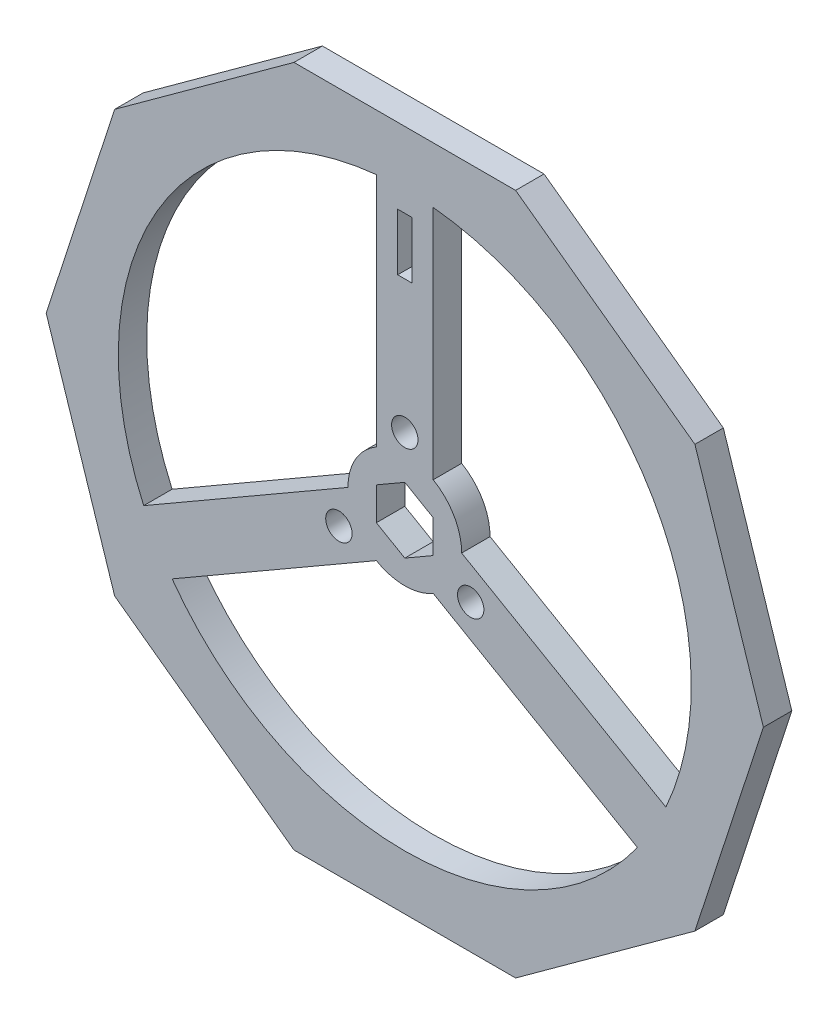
ISO-10303-21;
HEADER;
FILE_DESCRIPTION(('STEP AP214'),'2;1');
FILE_NAME('part.step','',(''),(''),'','','');
FILE_SCHEMA(('AUTOMOTIVE_DESIGN { 1 0 10303 214 1 1 1 1 }'));
ENDSEC;
DATA;
#1=APPLICATION_CONTEXT('core data for automotive mechanical design processes');
#2=APPLICATION_PROTOCOL_DEFINITION('international standard','automotive_design',2000,#1);
#3=PRODUCT_CONTEXT('',#1,'mechanical');
#4=PRODUCT('Part','Part','',(#3));
#5=PRODUCT_RELATED_PRODUCT_CATEGORY('part','',(#4));
#6=PRODUCT_DEFINITION_FORMATION('','',#4);
#7=PRODUCT_DEFINITION_CONTEXT('part definition',#1,'design');
#8=PRODUCT_DEFINITION('design','',#6,#7);
#9=PRODUCT_DEFINITION_SHAPE('','',#8);
#10=(LENGTH_UNIT() NAMED_UNIT(*) SI_UNIT(.MILLI.,.METRE.));
#11=(NAMED_UNIT(*) PLANE_ANGLE_UNIT() SI_UNIT($,.RADIAN.));
#12=(NAMED_UNIT(*) SI_UNIT($,.STERADIAN.) SOLID_ANGLE_UNIT());
#13=UNCERTAINTY_MEASURE_WITH_UNIT(LENGTH_MEASURE(1.E-05),#10,'distance_accuracy_value','');
#14=(GEOMETRIC_REPRESENTATION_CONTEXT(3) GLOBAL_UNCERTAINTY_ASSIGNED_CONTEXT((#13)) GLOBAL_UNIT_ASSIGNED_CONTEXT((#10,
#11,#12)) REPRESENTATION_CONTEXT('',''));
#15=CARTESIAN_POINT('',(0.,0.,0.));
#16=DIRECTION('',(0.,0.,1.));
#17=DIRECTION('',(1.,0.,0.));
#18=AXIS2_PLACEMENT_3D('',#15,#16,#17);
#19=CARTESIAN_POINT('',(0.,0.,3.175));
#20=DIRECTION('',(0.,0.,1.));
#21=DIRECTION('',(1.,0.,0.));
#22=AXIS2_PLACEMENT_3D('',#19,#20,#21);
#23=PLANE('',#22);
#24=CARTESIAN_POINT('',(0.,8.5,3.175));
#25=DIRECTION('',(0.,0.,1.));
#26=DIRECTION('',(1.,0.,0.));
#27=AXIS2_PLACEMENT_3D('',#24,#25,#26);
#28=CIRCLE('',#27,1.4732);
#29=CARTESIAN_POINT('',(1.4732,8.5,3.175));
#30=VERTEX_POINT('',#29);
#31=EDGE_CURVE('E883',#30,#30,#28,.T.);
#32=ORIENTED_EDGE('',*,*,#31,.F.);
#33=EDGE_LOOP('',(#32));
#34=FACE_BOUND('',#33,.T.);
#35=CARTESIAN_POINT('',(7.36121593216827,-4.24999999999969,3.175));
#36=DIRECTION('',(0.,0.,1.));
#37=DIRECTION('',(1.,0.,0.));
#38=AXIS2_PLACEMENT_3D('',#35,#36,#37);
#39=CIRCLE('',#38,1.4732);
#40=CARTESIAN_POINT('',(8.83441593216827,-4.24999999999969,3.175));
#41=VERTEX_POINT('',#40);
#42=EDGE_CURVE('E885',#41,#41,#39,.T.);
#43=ORIENTED_EDGE('',*,*,#42,.F.);
#44=EDGE_LOOP('',(#43));
#45=FACE_BOUND('',#44,.T.);
#46=CARTESIAN_POINT('',(-7.36121593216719,-4.25000000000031,3.175));
#47=DIRECTION('',(0.,0.,1.));
#48=DIRECTION('',(1.,0.,0.));
#49=AXIS2_PLACEMENT_3D('',#46,#47,#48);
#50=CIRCLE('',#49,1.4732);
#51=CARTESIAN_POINT('',(-5.88801593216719,-4.25000000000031,3.175));
#52=VERTEX_POINT('',#51);
#53=EDGE_CURVE('E893',#52,#52,#50,.T.);
#54=ORIENTED_EDGE('',*,*,#53,.F.);
#55=EDGE_LOOP('',(#54));
#56=FACE_BOUND('',#55,.T.);
#57=DIRECTION('',(0.866025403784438,0.5,0.));
#58=VECTOR('',#57,1.);
#59=CARTESIAN_POINT('',(-29.167049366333,-13.1734295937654,3.175));
#60=LINE('',#59,#58);
#61=CARTESIAN_POINT('',(-29.167049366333,-13.1734295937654,3.175));
#62=VERTEX_POINT('',#61);
#63=CARTESIAN_POINT('',(-6.35,0.,3.175));
#64=VERTEX_POINT('',#63);
#65=EDGE_CURVE('E282',#62,#64,#60,.T.);
#66=ORIENTED_EDGE('',*,*,#65,.F.);
#67=CARTESIAN_POINT('',(0.,0.,3.175));
#68=DIRECTION('',(0.,0.,1.));
#69=DIRECTION('',(1.,0.,0.));
#70=AXIS2_PLACEMENT_3D('',#67,#68,#69);
#71=CIRCLE('',#70,32.004);
#72=CARTESIAN_POINT('',(-3.175,31.8461205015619,3.175));
#73=VERTEX_POINT('',#72);
#74=EDGE_CURVE('E280',#73,#62,#71,.T.);
#75=ORIENTED_EDGE('',*,*,#74,.F.);
#76=DIRECTION('',(0.,1.,0.));
#77=VECTOR('',#76,1.);
#78=CARTESIAN_POINT('',(-3.175,31.8461205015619,3.175));
#79=LINE('',#78,#77);
#80=CARTESIAN_POINT('',(-3.175,5.49926131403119,3.175));
#81=VERTEX_POINT('',#80);
#82=EDGE_CURVE('E288',#81,#73,#79,.T.);
#83=ORIENTED_EDGE('',*,*,#82,.F.);
#84=CARTESIAN_POINT('',(0.,0.,3.175));
#85=DIRECTION('',(0.,0.,-1.));
#86=DIRECTION('',(-1.,0.,0.));
#87=AXIS2_PLACEMENT_3D('',#84,#85,#86);
#88=CIRCLE('',#87,6.35);
#89=EDGE_CURVE('E285',#64,#81,#88,.T.);
#90=ORIENTED_EDGE('',*,*,#89,.F.);
#91=EDGE_LOOP('',(#66,#75,#83,#90));
#92=FACE_BOUND('',#91,.T.);
#93=DIRECTION('',(0.,1.,0.));
#94=VECTOR('',#93,1.);
#95=CARTESIAN_POINT('',(3.175,-1.83308710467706,3.175));
#96=LINE('',#95,#94);
#97=CARTESIAN_POINT('',(3.175,-1.83308710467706,3.175));
#98=VERTEX_POINT('',#97);
#99=CARTESIAN_POINT('',(3.175,1.83308710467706,3.175));
#100=VERTEX_POINT('',#99);
#101=EDGE_CURVE('E344',#98,#100,#96,.T.);
#102=ORIENTED_EDGE('',*,*,#101,.F.);
#103=DIRECTION('',(0.866025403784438,0.5,0.));
#104=VECTOR('',#103,1.);
#105=CARTESIAN_POINT('',(0.,-3.66617420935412,3.175));
#106=LINE('',#105,#104);
#107=CARTESIAN_POINT('',(0.,-3.66617420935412,3.175));
#108=VERTEX_POINT('',#107);
#109=EDGE_CURVE('E342',#108,#98,#106,.T.);
#110=ORIENTED_EDGE('',*,*,#109,.F.);
#111=DIRECTION('',(0.866025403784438,-0.5,0.));
#112=VECTOR('',#111,1.);
#113=CARTESIAN_POINT('',(-3.175,-1.83308710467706,3.175));
#114=LINE('',#113,#112);
#115=CARTESIAN_POINT('',(-3.175,-1.83308710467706,3.175));
#116=VERTEX_POINT('',#115);
#117=EDGE_CURVE('E354',#116,#108,#114,.T.);
#118=ORIENTED_EDGE('',*,*,#117,.F.);
#119=DIRECTION('',(0.,-1.,0.));
#120=VECTOR('',#119,1.);
#121=CARTESIAN_POINT('',(-3.175,1.83308710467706,3.175));
#122=LINE('',#121,#120);
#123=CARTESIAN_POINT('',(-3.175,1.83308710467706,3.175));
#124=VERTEX_POINT('',#123);
#125=EDGE_CURVE('E351',#124,#116,#122,.T.);
#126=ORIENTED_EDGE('',*,*,#125,.F.);
#127=DIRECTION('',(-0.866025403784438,-0.5,0.));
#128=VECTOR('',#127,1.);
#129=CARTESIAN_POINT('',(0.,3.66617420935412,3.175));
#130=LINE('',#129,#128);
#131=CARTESIAN_POINT('',(0.,3.66617420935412,3.175));
#132=VERTEX_POINT('',#131);
#133=EDGE_CURVE('E349',#132,#124,#130,.T.);
#134=ORIENTED_EDGE('',*,*,#133,.F.);
#135=DIRECTION('',(-0.866025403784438,0.5,0.));
#136=VECTOR('',#135,1.);
#137=CARTESIAN_POINT('',(3.175,1.83308710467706,3.175));
#138=LINE('',#137,#136);
#139=EDGE_CURVE('E347',#100,#132,#138,.T.);
#140=ORIENTED_EDGE('',*,*,#139,.F.);
#141=EDGE_LOOP('',(#102,#110,#118,#126,#134,#140));
#142=FACE_BOUND('',#141,.T.);
#143=DIRECTION('',(-0.309016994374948,0.951056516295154,0.));
#144=VECTOR('',#143,1.);
#145=CARTESIAN_POINT('',(40.060710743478,0.,3.175));
#146=LINE('',#145,#144);
#147=CARTESIAN_POINT('',(40.060710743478,0.,3.175));
#148=VERTEX_POINT('',#147);
#149=CARTESIAN_POINT('',(32.4097957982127,23.547094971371,3.175));
#150=VERTEX_POINT('',#149);
#151=EDGE_CURVE('E418',#148,#150,#146,.T.);
#152=ORIENTED_EDGE('',*,*,#151,.T.);
#153=DIRECTION('',(-0.809016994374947,0.587785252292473,0.));
#154=VECTOR('',#153,1.);
#155=CARTESIAN_POINT('',(32.4097957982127,23.547094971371,3.175));
#156=LINE('',#155,#154);
#157=CARTESIAN_POINT('',(12.3794404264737,38.1,3.175));
#158=VERTEX_POINT('',#157);
#159=EDGE_CURVE('E421',#150,#158,#156,.T.);
#160=ORIENTED_EDGE('',*,*,#159,.T.);
#161=DIRECTION('',(-1.,0.,0.));
#162=VECTOR('',#161,1.);
#163=CARTESIAN_POINT('',(12.3794404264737,38.1,3.175));
#164=LINE('',#163,#162);
#165=CARTESIAN_POINT('',(-12.3794404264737,38.1,3.175));
#166=VERTEX_POINT('',#165);
#167=EDGE_CURVE('E424',#158,#166,#164,.T.);
#168=ORIENTED_EDGE('',*,*,#167,.T.);
#169=DIRECTION('',(-0.809016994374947,-0.587785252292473,0.));
#170=VECTOR('',#169,1.);
#171=CARTESIAN_POINT('',(-12.3794404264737,38.1,3.175));
#172=LINE('',#171,#170);
#173=CARTESIAN_POINT('',(-32.4097957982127,23.547094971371,3.175));
#174=VERTEX_POINT('',#173);
#175=EDGE_CURVE('E426',#166,#174,#172,.T.);
#176=ORIENTED_EDGE('',*,*,#175,.T.);
#177=DIRECTION('',(-0.309016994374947,-0.951056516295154,0.));
#178=VECTOR('',#177,1.);
#179=CARTESIAN_POINT('',(-32.4097957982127,23.547094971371,3.175));
#180=LINE('',#179,#178);
#181=CARTESIAN_POINT('',(-40.060710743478,0.,3.175));
#182=VERTEX_POINT('',#181);
#183=EDGE_CURVE('E428',#174,#182,#180,.T.);
#184=ORIENTED_EDGE('',*,*,#183,.T.);
#185=DIRECTION('',(0.309016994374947,-0.951056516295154,0.));
#186=VECTOR('',#185,1.);
#187=CARTESIAN_POINT('',(-40.060710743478,0.,3.175));
#188=LINE('',#187,#186);
#189=CARTESIAN_POINT('',(-32.4097957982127,-23.547094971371,3.175));
#190=VERTEX_POINT('',#189);
#191=EDGE_CURVE('E430',#182,#190,#188,.T.);
#192=ORIENTED_EDGE('',*,*,#191,.T.);
#193=DIRECTION('',(0.809016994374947,-0.587785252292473,0.));
#194=VECTOR('',#193,1.);
#195=CARTESIAN_POINT('',(-32.4097957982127,-23.547094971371,3.175));
#196=LINE('',#195,#194);
#197=CARTESIAN_POINT('',(-12.3794404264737,-38.1,3.175));
#198=VERTEX_POINT('',#197);
#199=EDGE_CURVE('E432',#190,#198,#196,.T.);
#200=ORIENTED_EDGE('',*,*,#199,.T.);
#201=DIRECTION('',(1.,0.,0.));
#202=VECTOR('',#201,1.);
#203=CARTESIAN_POINT('',(-12.3794404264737,-38.1,3.175));
#204=LINE('',#203,#202);
#205=CARTESIAN_POINT('',(12.3794404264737,-38.1,3.175));
#206=VERTEX_POINT('',#205);
#207=EDGE_CURVE('E434',#198,#206,#204,.T.);
#208=ORIENTED_EDGE('',*,*,#207,.T.);
#209=DIRECTION('',(0.809016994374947,0.587785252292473,0.));
#210=VECTOR('',#209,1.);
#211=CARTESIAN_POINT('',(12.3794404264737,-38.1,3.175));
#212=LINE('',#211,#210);
#213=CARTESIAN_POINT('',(32.4097957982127,-23.547094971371,3.175));
#214=VERTEX_POINT('',#213);
#215=EDGE_CURVE('E436',#206,#214,#212,.T.);
#216=ORIENTED_EDGE('',*,*,#215,.T.);
#217=DIRECTION('',(0.309016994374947,0.951056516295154,0.));
#218=VECTOR('',#217,1.);
#219=CARTESIAN_POINT('',(32.4097957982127,-23.547094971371,3.175));
#220=LINE('',#219,#218);
#221=EDGE_CURVE('E438',#214,#148,#220,.T.);
#222=ORIENTED_EDGE('',*,*,#221,.T.);
#223=EDGE_LOOP('',(#152,#160,#168,#176,#184,#192,#200,#208,#216,#222));
#224=FACE_BOUND('',#223,.T.);
#225=DIRECTION('',(1.,0.,0.));
#226=VECTOR('',#225,1.);
#227=CARTESIAN_POINT('',(-0.79375,23.3445448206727,3.175));
#228=LINE('',#227,#226);
#229=CARTESIAN_POINT('',(-0.79375,23.3445448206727,3.175));
#230=VERTEX_POINT('',#229);
#231=CARTESIAN_POINT('',(0.79375,23.3445448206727,3.175));
#232=VERTEX_POINT('',#231);
#233=EDGE_CURVE('E389',#230,#232,#228,.T.);
#234=ORIENTED_EDGE('',*,*,#233,.F.);
#235=DIRECTION('',(0.,-1.,0.));
#236=VECTOR('',#235,1.);
#237=CARTESIAN_POINT('',(-0.793750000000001,29.6945448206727,3.175));
#238=LINE('',#237,#236);
#239=CARTESIAN_POINT('',(-0.793750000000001,29.6945448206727,3.175));
#240=VERTEX_POINT('',#239);
#241=EDGE_CURVE('E387',#240,#230,#238,.T.);
#242=ORIENTED_EDGE('',*,*,#241,.F.);
#243=DIRECTION('',(-1.,0.,0.));
#244=VECTOR('',#243,1.);
#245=CARTESIAN_POINT('',(-0.793750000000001,29.6945448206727,3.175));
#246=LINE('',#245,#244);
#247=CARTESIAN_POINT('',(0.793750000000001,29.6945448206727,3.175));
#248=VERTEX_POINT('',#247);
#249=EDGE_CURVE('E395',#248,#240,#246,.T.);
#250=ORIENTED_EDGE('',*,*,#249,.F.);
#251=DIRECTION('',(0.,1.,0.));
#252=VECTOR('',#251,1.);
#253=CARTESIAN_POINT('',(0.793750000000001,29.6945448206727,3.175));
#254=LINE('',#253,#252);
#255=EDGE_CURVE('E392',#232,#248,#254,.T.);
#256=ORIENTED_EDGE('',*,*,#255,.F.);
#257=EDGE_LOOP('',(#234,#242,#250,#256));
#258=FACE_BOUND('',#257,.T.);
#259=DIRECTION('',(0.,-1.,0.));
#260=VECTOR('',#259,1.);
#261=CARTESIAN_POINT('',(3.175,31.8461205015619,3.175));
#262=LINE('',#261,#260);
#263=CARTESIAN_POINT('',(3.175,31.8461205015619,3.175));
#264=VERTEX_POINT('',#263);
#265=CARTESIAN_POINT('',(3.175,5.49926131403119,3.175));
#266=VERTEX_POINT('',#265);
#267=EDGE_CURVE('E313',#264,#266,#262,.T.);
#268=ORIENTED_EDGE('',*,*,#267,.F.);
#269=CARTESIAN_POINT('',(0.,0.,3.175));
#270=DIRECTION('',(0.,0.,1.));
#271=DIRECTION('',(-1.,0.,0.));
#272=AXIS2_PLACEMENT_3D('',#269,#270,#271);
#273=CIRCLE('',#272,32.004);
#274=CARTESIAN_POINT('',(29.167049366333,-13.1734295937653,3.175));
#275=VERTEX_POINT('',#274);
#276=EDGE_CURVE('E311',#275,#264,#273,.T.);
#277=ORIENTED_EDGE('',*,*,#276,.F.);
#278=DIRECTION('',(0.866025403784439,-0.5,0.));
#279=VECTOR('',#278,1.);
#280=CARTESIAN_POINT('',(29.167049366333,-13.1734295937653,3.175));
#281=LINE('',#280,#279);
#282=CARTESIAN_POINT('',(6.35,0.,3.175));
#283=VERTEX_POINT('',#282);
#284=EDGE_CURVE('E319',#283,#275,#281,.T.);
#285=ORIENTED_EDGE('',*,*,#284,.F.);
#286=CARTESIAN_POINT('',(0.,0.,3.175));
#287=DIRECTION('',(0.,0.,-1.));
#288=DIRECTION('',(1.,0.,0.));
#289=AXIS2_PLACEMENT_3D('',#286,#287,#288);
#290=CIRCLE('',#289,6.35);
#291=EDGE_CURVE('E316',#266,#283,#290,.T.);
#292=ORIENTED_EDGE('',*,*,#291,.F.);
#293=EDGE_LOOP('',(#268,#277,#285,#292));
#294=FACE_BOUND('',#293,.T.);
#295=DIRECTION('',(-0.866025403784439,0.5,0.));
#296=VECTOR('',#295,1.);
#297=CARTESIAN_POINT('',(25.992049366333,-18.6726909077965,3.175));
#298=LINE('',#297,#296);
#299=CARTESIAN_POINT('',(25.992049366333,-18.6726909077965,3.175));
#300=VERTEX_POINT('',#299);
#301=CARTESIAN_POINT('',(3.175,-5.49926131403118,3.175));
#302=VERTEX_POINT('',#301);
#303=EDGE_CURVE('E250',#300,#302,#298,.T.);
#304=ORIENTED_EDGE('',*,*,#303,.F.);
#305=CARTESIAN_POINT('',(0.,0.,3.175));
#306=DIRECTION('',(0.,0.,1.));
#307=DIRECTION('',(-1.,0.,0.));
#308=AXIS2_PLACEMENT_3D('',#305,#306,#307);
#309=CIRCLE('',#308,32.004);
#310=CARTESIAN_POINT('',(-25.992049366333,-18.6726909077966,3.175));
#311=VERTEX_POINT('',#310);
#312=EDGE_CURVE('E242',#311,#300,#309,.T.);
#313=ORIENTED_EDGE('',*,*,#312,.F.);
#314=DIRECTION('',(-0.866025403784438,-0.500000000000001,0.));
#315=VECTOR('',#314,1.);
#316=CARTESIAN_POINT('',(-25.992049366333,-18.6726909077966,3.175));
#317=LINE('',#316,#315);
#318=CARTESIAN_POINT('',(-3.17499999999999,-5.49926131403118,3.175));
#319=VERTEX_POINT('',#318);
#320=EDGE_CURVE('E264',#319,#311,#317,.T.);
#321=ORIENTED_EDGE('',*,*,#320,.F.);
#322=CARTESIAN_POINT('',(0.,0.,3.175));
#323=DIRECTION('',(0.,0.,-1.));
#324=DIRECTION('',(-1.,0.,0.));
#325=AXIS2_PLACEMENT_3D('',#322,#323,#324);
#326=CIRCLE('',#325,6.35);
#327=EDGE_CURVE('E262',#302,#319,#326,.T.);
#328=ORIENTED_EDGE('',*,*,#327,.F.);
#329=EDGE_LOOP('',(#304,#313,#321,#328));
#330=FACE_BOUND('',#329,.T.);
#331=ADVANCED_FACE('F33',(#34,#45,#56,#92,#142,#224,#258,#294,#330),#23,.T.);
#332=CARTESIAN_POINT('',(0.,0.,0.));
#333=DIRECTION('',(0.,0.,1.));
#334=DIRECTION('',(1.,0.,0.));
#335=AXIS2_PLACEMENT_3D('',#332,#333,#334);
#336=PLANE('',#335);
#337=CARTESIAN_POINT('',(0.,8.5,0.));
#338=DIRECTION('',(0.,0.,1.));
#339=DIRECTION('',(1.,0.,0.));
#340=AXIS2_PLACEMENT_3D('',#337,#338,#339);
#341=CIRCLE('',#340,1.4732);
#342=CARTESIAN_POINT('',(1.4732,8.5,0.));
#343=VERTEX_POINT('',#342);
#344=EDGE_CURVE('E881',#343,#343,#341,.T.);
#345=ORIENTED_EDGE('',*,*,#344,.T.);
#346=EDGE_LOOP('',(#345));
#347=FACE_BOUND('',#346,.T.);
#348=CARTESIAN_POINT('',(7.36121593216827,-4.24999999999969,0.));
#349=DIRECTION('',(0.,0.,1.));
#350=DIRECTION('',(1.,0.,0.));
#351=AXIS2_PLACEMENT_3D('',#348,#349,#350);
#352=CIRCLE('',#351,1.4732);
#353=CARTESIAN_POINT('',(8.83441593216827,-4.24999999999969,0.));
#354=VERTEX_POINT('',#353);
#355=EDGE_CURVE('E890',#354,#354,#352,.T.);
#356=ORIENTED_EDGE('',*,*,#355,.T.);
#357=EDGE_LOOP('',(#356));
#358=FACE_BOUND('',#357,.T.);
#359=CARTESIAN_POINT('',(-7.36121593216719,-4.25000000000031,0.));
#360=DIRECTION('',(0.,0.,1.));
#361=DIRECTION('',(1.,0.,0.));
#362=AXIS2_PLACEMENT_3D('',#359,#360,#361);
#363=CIRCLE('',#362,1.4732);
#364=CARTESIAN_POINT('',(-5.88801593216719,-4.25000000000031,0.));
#365=VERTEX_POINT('',#364);
#366=EDGE_CURVE('E270',#365,#365,#363,.T.);
#367=ORIENTED_EDGE('',*,*,#366,.T.);
#368=EDGE_LOOP('',(#367));
#369=FACE_BOUND('',#368,.T.);
#370=CARTESIAN_POINT('',(0.,0.,0.));
#371=DIRECTION('',(0.,0.,1.));
#372=DIRECTION('',(1.,0.,0.));
#373=AXIS2_PLACEMENT_3D('',#370,#371,#372);
#374=CIRCLE('',#373,32.004);
#375=CARTESIAN_POINT('',(-3.175,31.8461205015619,0.));
#376=VERTEX_POINT('',#375);
#377=CARTESIAN_POINT('',(-29.167049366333,-13.1734295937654,0.));
#378=VERTEX_POINT('',#377);
#379=EDGE_CURVE('E258',#376,#378,#374,.T.);
#380=ORIENTED_EDGE('',*,*,#379,.T.);
#381=DIRECTION('',(0.866025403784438,0.5,0.));
#382=VECTOR('',#381,1.);
#383=CARTESIAN_POINT('',(-29.167049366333,-13.1734295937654,0.));
#384=LINE('',#383,#382);
#385=CARTESIAN_POINT('',(-6.35,0.,0.));
#386=VERTEX_POINT('',#385);
#387=EDGE_CURVE('E293',#378,#386,#384,.T.);
#388=ORIENTED_EDGE('',*,*,#387,.T.);
#389=CARTESIAN_POINT('',(0.,0.,0.));
#390=DIRECTION('',(0.,0.,-1.));
#391=DIRECTION('',(-1.,0.,0.));
#392=AXIS2_PLACEMENT_3D('',#389,#390,#391);
#393=CIRCLE('',#392,6.35);
#394=CARTESIAN_POINT('',(-3.175,5.49926131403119,0.));
#395=VERTEX_POINT('',#394);
#396=EDGE_CURVE('E296',#386,#395,#393,.T.);
#397=ORIENTED_EDGE('',*,*,#396,.T.);
#398=DIRECTION('',(0.,1.,0.));
#399=VECTOR('',#398,1.);
#400=CARTESIAN_POINT('',(-3.175,31.8461205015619,0.));
#401=LINE('',#400,#399);
#402=EDGE_CURVE('E283',#395,#376,#401,.T.);
#403=ORIENTED_EDGE('',*,*,#402,.T.);
#404=EDGE_LOOP('',(#380,#388,#397,#403));
#405=FACE_BOUND('',#404,.T.);
#406=DIRECTION('',(0.866025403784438,0.5,0.));
#407=VECTOR('',#406,1.);
#408=CARTESIAN_POINT('',(0.,-3.66617420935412,0.));
#409=LINE('',#408,#407);
#410=CARTESIAN_POINT('',(0.,-3.66617420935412,0.));
#411=VERTEX_POINT('',#410);
#412=CARTESIAN_POINT('',(3.175,-1.83308710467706,0.));
#413=VERTEX_POINT('',#412);
#414=EDGE_CURVE('E341',#411,#413,#409,.T.);
#415=ORIENTED_EDGE('',*,*,#414,.T.);
#416=DIRECTION('',(0.,1.,0.));
#417=VECTOR('',#416,1.);
#418=CARTESIAN_POINT('',(3.175,-1.83308710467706,0.));
#419=LINE('',#418,#417);
#420=CARTESIAN_POINT('',(3.175,1.83308710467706,0.));
#421=VERTEX_POINT('',#420);
#422=EDGE_CURVE('E359',#413,#421,#419,.T.);
#423=ORIENTED_EDGE('',*,*,#422,.T.);
#424=DIRECTION('',(-0.866025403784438,0.5,0.));
#425=VECTOR('',#424,1.);
#426=CARTESIAN_POINT('',(3.175,1.83308710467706,0.));
#427=LINE('',#426,#425);
#428=CARTESIAN_POINT('',(0.,3.66617420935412,0.));
#429=VERTEX_POINT('',#428);
#430=EDGE_CURVE('E362',#421,#429,#427,.T.);
#431=ORIENTED_EDGE('',*,*,#430,.T.);
#432=DIRECTION('',(-0.866025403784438,-0.5,0.));
#433=VECTOR('',#432,1.);
#434=CARTESIAN_POINT('',(0.,3.66617420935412,0.));
#435=LINE('',#434,#433);
#436=CARTESIAN_POINT('',(-3.175,1.83308710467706,0.));
#437=VERTEX_POINT('',#436);
#438=EDGE_CURVE('E365',#429,#437,#435,.T.);
#439=ORIENTED_EDGE('',*,*,#438,.T.);
#440=DIRECTION('',(0.,-1.,0.));
#441=VECTOR('',#440,1.);
#442=CARTESIAN_POINT('',(-3.175,1.83308710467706,0.));
#443=LINE('',#442,#441);
#444=CARTESIAN_POINT('',(-3.175,-1.83308710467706,0.));
#445=VERTEX_POINT('',#444);
#446=EDGE_CURVE('E368',#437,#445,#443,.T.);
#447=ORIENTED_EDGE('',*,*,#446,.T.);
#448=DIRECTION('',(0.866025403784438,-0.5,0.));
#449=VECTOR('',#448,1.);
#450=CARTESIAN_POINT('',(-3.175,-1.83308710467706,0.));
#451=LINE('',#450,#449);
#452=EDGE_CURVE('E345',#445,#411,#451,.T.);
#453=ORIENTED_EDGE('',*,*,#452,.T.);
#454=EDGE_LOOP('',(#415,#423,#431,#439,#447,#453));
#455=FACE_BOUND('',#454,.T.);
#456=DIRECTION('',(-0.309016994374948,0.951056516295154,0.));
#457=VECTOR('',#456,1.);
#458=CARTESIAN_POINT('',(40.060710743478,0.,0.));
#459=LINE('',#458,#457);
#460=CARTESIAN_POINT('',(40.060710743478,0.,0.));
#461=VERTEX_POINT('',#460);
#462=CARTESIAN_POINT('',(32.4097957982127,23.547094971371,0.));
#463=VERTEX_POINT('',#462);
#464=EDGE_CURVE('E417',#461,#463,#459,.T.);
#465=ORIENTED_EDGE('',*,*,#464,.F.);
#466=DIRECTION('',(0.309016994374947,0.951056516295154,0.));
#467=VECTOR('',#466,1.);
#468=CARTESIAN_POINT('',(32.4097957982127,-23.547094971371,0.));
#469=LINE('',#468,#467);
#470=CARTESIAN_POINT('',(32.4097957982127,-23.547094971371,0.));
#471=VERTEX_POINT('',#470);
#472=EDGE_CURVE('E422',#471,#461,#469,.T.);
#473=ORIENTED_EDGE('',*,*,#472,.F.);
#474=DIRECTION('',(0.809016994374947,0.587785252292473,0.));
#475=VECTOR('',#474,1.);
#476=CARTESIAN_POINT('',(12.3794404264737,-38.1,0.));
#477=LINE('',#476,#475);
#478=CARTESIAN_POINT('',(12.3794404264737,-38.1,0.));
#479=VERTEX_POINT('',#478);
#480=EDGE_CURVE('E457',#479,#471,#477,.T.);
#481=ORIENTED_EDGE('',*,*,#480,.F.);
#482=DIRECTION('',(1.,0.,0.));
#483=VECTOR('',#482,1.);
#484=CARTESIAN_POINT('',(-12.3794404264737,-38.1,0.));
#485=LINE('',#484,#483);
#486=CARTESIAN_POINT('',(-12.3794404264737,-38.1,0.));
#487=VERTEX_POINT('',#486);
#488=EDGE_CURVE('E455',#487,#479,#485,.T.);
#489=ORIENTED_EDGE('',*,*,#488,.F.);
#490=DIRECTION('',(0.809016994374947,-0.587785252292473,0.));
#491=VECTOR('',#490,1.);
#492=CARTESIAN_POINT('',(-32.4097957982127,-23.547094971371,0.));
#493=LINE('',#492,#491);
#494=CARTESIAN_POINT('',(-32.4097957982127,-23.547094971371,0.));
#495=VERTEX_POINT('',#494);
#496=EDGE_CURVE('E453',#495,#487,#493,.T.);
#497=ORIENTED_EDGE('',*,*,#496,.F.);
#498=DIRECTION('',(0.309016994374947,-0.951056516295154,0.));
#499=VECTOR('',#498,1.);
#500=CARTESIAN_POINT('',(-40.060710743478,0.,0.));
#501=LINE('',#500,#499);
#502=CARTESIAN_POINT('',(-40.060710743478,0.,0.));
#503=VERTEX_POINT('',#502);
#504=EDGE_CURVE('E451',#503,#495,#501,.T.);
#505=ORIENTED_EDGE('',*,*,#504,.F.);
#506=DIRECTION('',(-0.309016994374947,-0.951056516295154,0.));
#507=VECTOR('',#506,1.);
#508=CARTESIAN_POINT('',(-32.4097957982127,23.547094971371,0.));
#509=LINE('',#508,#507);
#510=CARTESIAN_POINT('',(-32.4097957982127,23.547094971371,0.));
#511=VERTEX_POINT('',#510);
#512=EDGE_CURVE('E449',#511,#503,#509,.T.);
#513=ORIENTED_EDGE('',*,*,#512,.F.);
#514=DIRECTION('',(-0.809016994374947,-0.587785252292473,0.));
#515=VECTOR('',#514,1.);
#516=CARTESIAN_POINT('',(-12.3794404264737,38.1,0.));
#517=LINE('',#516,#515);
#518=CARTESIAN_POINT('',(-12.3794404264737,38.1,0.));
#519=VERTEX_POINT('',#518);
#520=EDGE_CURVE('E447',#519,#511,#517,.T.);
#521=ORIENTED_EDGE('',*,*,#520,.F.);
#522=DIRECTION('',(-1.,0.,0.));
#523=VECTOR('',#522,1.);
#524=CARTESIAN_POINT('',(12.3794404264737,38.1,0.));
#525=LINE('',#524,#523);
#526=CARTESIAN_POINT('',(12.3794404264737,38.1,0.));
#527=VERTEX_POINT('',#526);
#528=EDGE_CURVE('E445',#527,#519,#525,.T.);
#529=ORIENTED_EDGE('',*,*,#528,.F.);
#530=DIRECTION('',(-0.809016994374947,0.587785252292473,0.));
#531=VECTOR('',#530,1.);
#532=CARTESIAN_POINT('',(32.4097957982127,23.547094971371,0.));
#533=LINE('',#532,#531);
#534=EDGE_CURVE('E443',#463,#527,#533,.T.);
#535=ORIENTED_EDGE('',*,*,#534,.F.);
#536=EDGE_LOOP('',(#465,#473,#481,#489,#497,#505,#513,#521,#529,#535));
#537=FACE_BOUND('',#536,.T.);
#538=DIRECTION('',(0.,-1.,0.));
#539=VECTOR('',#538,1.);
#540=CARTESIAN_POINT('',(-0.793750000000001,29.6945448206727,0.));
#541=LINE('',#540,#539);
#542=CARTESIAN_POINT('',(-0.793750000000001,29.6945448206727,0.));
#543=VERTEX_POINT('',#542);
#544=CARTESIAN_POINT('',(-0.79375,23.3445448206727,0.));
#545=VERTEX_POINT('',#544);
#546=EDGE_CURVE('E386',#543,#545,#541,.T.);
#547=ORIENTED_EDGE('',*,*,#546,.T.);
#548=DIRECTION('',(1.,0.,0.));
#549=VECTOR('',#548,1.);
#550=CARTESIAN_POINT('',(-0.79375,23.3445448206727,0.));
#551=LINE('',#550,#549);
#552=CARTESIAN_POINT('',(0.79375,23.3445448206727,0.));
#553=VERTEX_POINT('',#552);
#554=EDGE_CURVE('E400',#545,#553,#551,.T.);
#555=ORIENTED_EDGE('',*,*,#554,.T.);
#556=DIRECTION('',(0.,1.,0.));
#557=VECTOR('',#556,1.);
#558=CARTESIAN_POINT('',(0.793750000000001,29.6945448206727,0.));
#559=LINE('',#558,#557);
#560=CARTESIAN_POINT('',(0.793750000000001,29.6945448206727,0.));
#561=VERTEX_POINT('',#560);
#562=EDGE_CURVE('E403',#553,#561,#559,.T.);
#563=ORIENTED_EDGE('',*,*,#562,.T.);
#564=DIRECTION('',(-1.,0.,0.));
#565=VECTOR('',#564,1.);
#566=CARTESIAN_POINT('',(-0.793750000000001,29.6945448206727,0.));
#567=LINE('',#566,#565);
#568=EDGE_CURVE('E390',#561,#543,#567,.T.);
#569=ORIENTED_EDGE('',*,*,#568,.T.);
#570=EDGE_LOOP('',(#547,#555,#563,#569));
#571=FACE_BOUND('',#570,.T.);
#572=CARTESIAN_POINT('',(0.,0.,0.));
#573=DIRECTION('',(0.,0.,1.));
#574=DIRECTION('',(-1.,0.,0.));
#575=AXIS2_PLACEMENT_3D('',#572,#573,#574);
#576=CIRCLE('',#575,32.004);
#577=CARTESIAN_POINT('',(29.167049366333,-13.1734295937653,0.));
#578=VERTEX_POINT('',#577);
#579=CARTESIAN_POINT('',(3.175,31.8461205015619,0.));
#580=VERTEX_POINT('',#579);
#581=EDGE_CURVE('E310',#578,#580,#576,.T.);
#582=ORIENTED_EDGE('',*,*,#581,.T.);
#583=DIRECTION('',(0.,-1.,0.));
#584=VECTOR('',#583,1.);
#585=CARTESIAN_POINT('',(3.175,31.8461205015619,0.));
#586=LINE('',#585,#584);
#587=CARTESIAN_POINT('',(3.175,5.49926131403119,0.));
#588=VERTEX_POINT('',#587);
#589=EDGE_CURVE('E324',#580,#588,#586,.T.);
#590=ORIENTED_EDGE('',*,*,#589,.T.);
#591=CARTESIAN_POINT('',(0.,0.,0.));
#592=DIRECTION('',(0.,0.,-1.));
#593=DIRECTION('',(1.,0.,0.));
#594=AXIS2_PLACEMENT_3D('',#591,#592,#593);
#595=CIRCLE('',#594,6.35);
#596=CARTESIAN_POINT('',(6.35,0.,0.));
#597=VERTEX_POINT('',#596);
#598=EDGE_CURVE('E327',#588,#597,#595,.T.);
#599=ORIENTED_EDGE('',*,*,#598,.T.);
#600=DIRECTION('',(0.866025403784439,-0.5,0.));
#601=VECTOR('',#600,1.);
#602=CARTESIAN_POINT('',(29.167049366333,-13.1734295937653,0.));
#603=LINE('',#602,#601);
#604=EDGE_CURVE('E314',#597,#578,#603,.T.);
#605=ORIENTED_EDGE('',*,*,#604,.T.);
#606=EDGE_LOOP('',(#582,#590,#599,#605));
#607=FACE_BOUND('',#606,.T.);
#608=CARTESIAN_POINT('',(0.,0.,0.));
#609=DIRECTION('',(0.,0.,1.));
#610=DIRECTION('',(-1.,0.,0.));
#611=AXIS2_PLACEMENT_3D('',#608,#609,#610);
#612=CIRCLE('',#611,32.004);
#613=CARTESIAN_POINT('',(-25.992049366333,-18.6726909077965,0.));
#614=VERTEX_POINT('',#613);
#615=CARTESIAN_POINT('',(25.992049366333,-18.6726909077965,0.));
#616=VERTEX_POINT('',#615);
#617=EDGE_CURVE('E56',#614,#616,#612,.T.);
#618=ORIENTED_EDGE('',*,*,#617,.T.);
#619=DIRECTION('',(-0.866025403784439,0.5,0.));
#620=VECTOR('',#619,1.);
#621=CARTESIAN_POINT('',(25.992049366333,-18.6726909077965,0.));
#622=LINE('',#621,#620);
#623=CARTESIAN_POINT('',(3.175,-5.49926131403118,0.));
#624=VERTEX_POINT('',#623);
#625=EDGE_CURVE('E257',#616,#624,#622,.T.);
#626=ORIENTED_EDGE('',*,*,#625,.T.);
#627=CARTESIAN_POINT('',(0.,0.,0.));
#628=DIRECTION('',(0.,0.,-1.));
#629=DIRECTION('',(-1.,0.,0.));
#630=AXIS2_PLACEMENT_3D('',#627,#628,#629);
#631=CIRCLE('',#630,6.35);
#632=CARTESIAN_POINT('',(-3.17499999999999,-5.49926131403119,0.));
#633=VERTEX_POINT('',#632);
#634=EDGE_CURVE('E272',#624,#633,#631,.T.);
#635=ORIENTED_EDGE('',*,*,#634,.T.);
#636=DIRECTION('',(-0.866025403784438,-0.500000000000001,0.));
#637=VECTOR('',#636,1.);
#638=CARTESIAN_POINT('',(-25.992049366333,-18.6726909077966,0.));
#639=LINE('',#638,#637);
#640=EDGE_CURVE('E251',#633,#614,#639,.T.);
#641=ORIENTED_EDGE('',*,*,#640,.T.);
#642=EDGE_LOOP('',(#618,#626,#635,#641));
#643=FACE_BOUND('',#642,.T.);
#644=ADVANCED_FACE('F493',(#347,#358,#369,#405,#455,#537,#571,#607,#643),#336,.F.);
#645=CARTESIAN_POINT('',(40.060710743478,0.,3.175));
#646=DIRECTION('',(-0.951056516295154,-0.309016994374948,0.));
#647=DIRECTION('',(0.309016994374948,-0.951056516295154,0.));
#648=AXIS2_PLACEMENT_3D('',#645,#646,#647);
#649=PLANE('',#648);
#650=ORIENTED_EDGE('',*,*,#464,.T.);
#651=DIRECTION('',(0.,0.,-1.));
#652=VECTOR('',#651,1.);
#653=CARTESIAN_POINT('',(32.4097957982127,23.547094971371,3.175));
#654=LINE('',#653,#652);
#655=EDGE_CURVE('E11',#150,#463,#654,.T.);
#656=ORIENTED_EDGE('',*,*,#655,.F.);
#657=ORIENTED_EDGE('',*,*,#151,.F.);
#658=DIRECTION('',(0.,0.,-1.));
#659=VECTOR('',#658,1.);
#660=CARTESIAN_POINT('',(40.060710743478,0.,3.175));
#661=LINE('',#660,#659);
#662=EDGE_CURVE('E440',#148,#461,#661,.T.);
#663=ORIENTED_EDGE('',*,*,#662,.T.);
#664=EDGE_LOOP('',(#650,#656,#657,#663));
#665=FACE_BOUND('',#664,.T.);
#666=ADVANCED_FACE('F35',(#665),#649,.F.);
#667=CARTESIAN_POINT('',(32.4097957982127,23.547094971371,3.175));
#668=DIRECTION('',(-0.587785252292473,-0.809016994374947,0.));
#669=DIRECTION('',(0.809016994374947,-0.587785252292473,0.));
#670=AXIS2_PLACEMENT_3D('',#667,#668,#669);
#671=PLANE('',#670);
#672=ORIENTED_EDGE('',*,*,#534,.T.);
#673=DIRECTION('',(0.,0.,-1.));
#674=VECTOR('',#673,1.);
#675=CARTESIAN_POINT('',(12.3794404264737,38.1,3.175));
#676=LINE('',#675,#674);
#677=EDGE_CURVE('E41',#158,#527,#676,.T.);
#678=ORIENTED_EDGE('',*,*,#677,.F.);
#679=ORIENTED_EDGE('',*,*,#159,.F.);
#680=ORIENTED_EDGE('',*,*,#655,.T.);
#681=EDGE_LOOP('',(#672,#678,#679,#680));
#682=FACE_BOUND('',#681,.T.);
#683=ADVANCED_FACE('F511',(#682),#671,.F.);
#684=CARTESIAN_POINT('',(12.3794404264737,38.1,3.175));
#685=DIRECTION('',(0.,-1.,0.));
#686=DIRECTION('',(0.,0.,-1.));
#687=AXIS2_PLACEMENT_3D('',#684,#685,#686);
#688=PLANE('',#687);
#689=ORIENTED_EDGE('',*,*,#528,.T.);
#690=DIRECTION('',(0.,0.,-1.));
#691=VECTOR('',#690,1.);
#692=CARTESIAN_POINT('',(-12.3794404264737,38.1,3.175));
#693=LINE('',#692,#691);
#694=EDGE_CURVE('E480',#166,#519,#693,.T.);
#695=ORIENTED_EDGE('',*,*,#694,.F.);
#696=ORIENTED_EDGE('',*,*,#167,.F.);
#697=ORIENTED_EDGE('',*,*,#677,.T.);
#698=EDGE_LOOP('',(#689,#695,#696,#697));
#699=FACE_BOUND('',#698,.T.);
#700=ADVANCED_FACE('F487',(#699),#688,.F.);
#701=CARTESIAN_POINT('',(-12.3794404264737,38.1,3.175));
#702=DIRECTION('',(0.587785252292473,-0.809016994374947,0.));
#703=DIRECTION('',(0.809016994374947,0.587785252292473,0.));
#704=AXIS2_PLACEMENT_3D('',#701,#702,#703);
#705=PLANE('',#704);
#706=ORIENTED_EDGE('',*,*,#520,.T.);
#707=DIRECTION('',(0.,0.,-1.));
#708=VECTOR('',#707,1.);
#709=CARTESIAN_POINT('',(-32.4097957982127,23.547094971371,3.175));
#710=LINE('',#709,#708);
#711=EDGE_CURVE('E477',#174,#511,#710,.T.);
#712=ORIENTED_EDGE('',*,*,#711,.F.);
#713=ORIENTED_EDGE('',*,*,#175,.F.);
#714=ORIENTED_EDGE('',*,*,#694,.T.);
#715=EDGE_LOOP('',(#706,#712,#713,#714));
#716=FACE_BOUND('',#715,.T.);
#717=ADVANCED_FACE('F499',(#716),#705,.F.);
#718=CARTESIAN_POINT('',(-32.4097957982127,23.547094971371,3.175));
#719=DIRECTION('',(0.951056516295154,-0.309016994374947,0.));
#720=DIRECTION('',(0.309016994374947,0.951056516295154,0.));
#721=AXIS2_PLACEMENT_3D('',#718,#719,#720);
#722=PLANE('',#721);
#723=ORIENTED_EDGE('',*,*,#512,.T.);
#724=DIRECTION('',(0.,0.,-1.));
#725=VECTOR('',#724,1.);
#726=CARTESIAN_POINT('',(-40.060710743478,0.,3.175));
#727=LINE('',#726,#725);
#728=EDGE_CURVE('E474',#182,#503,#727,.T.);
#729=ORIENTED_EDGE('',*,*,#728,.F.);
#730=ORIENTED_EDGE('',*,*,#183,.F.);
#731=ORIENTED_EDGE('',*,*,#711,.T.);
#732=EDGE_LOOP('',(#723,#729,#730,#731));
#733=FACE_BOUND('',#732,.T.);
#734=ADVANCED_FACE('F503',(#733),#722,.F.);
#735=CARTESIAN_POINT('',(-40.060710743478,0.,3.175));
#736=DIRECTION('',(0.951056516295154,0.309016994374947,0.));
#737=DIRECTION('',(-0.309016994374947,0.951056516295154,0.));
#738=AXIS2_PLACEMENT_3D('',#735,#736,#737);
#739=PLANE('',#738);
#740=ORIENTED_EDGE('',*,*,#504,.T.);
#741=DIRECTION('',(0.,0.,-1.));
#742=VECTOR('',#741,1.);
#743=CARTESIAN_POINT('',(-32.4097957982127,-23.547094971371,3.175));
#744=LINE('',#743,#742);
#745=EDGE_CURVE('E471',#190,#495,#744,.T.);
#746=ORIENTED_EDGE('',*,*,#745,.F.);
#747=ORIENTED_EDGE('',*,*,#191,.F.);
#748=ORIENTED_EDGE('',*,*,#728,.T.);
#749=EDGE_LOOP('',(#740,#746,#747,#748));
#750=FACE_BOUND('',#749,.T.);
#751=ADVANCED_FACE('F534',(#750),#739,.F.);
#752=CARTESIAN_POINT('',(-32.4097957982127,-23.547094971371,3.175));
#753=DIRECTION('',(0.587785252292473,0.809016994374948,0.));
#754=DIRECTION('',(-0.809016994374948,0.587785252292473,0.));
#755=AXIS2_PLACEMENT_3D('',#752,#753,#754);
#756=PLANE('',#755);
#757=ORIENTED_EDGE('',*,*,#496,.T.);
#758=DIRECTION('',(0.,0.,-1.));
#759=VECTOR('',#758,1.);
#760=CARTESIAN_POINT('',(-12.3794404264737,-38.1,3.175));
#761=LINE('',#760,#759);
#762=EDGE_CURVE('E468',#198,#487,#761,.T.);
#763=ORIENTED_EDGE('',*,*,#762,.F.);
#764=ORIENTED_EDGE('',*,*,#199,.F.);
#765=ORIENTED_EDGE('',*,*,#745,.T.);
#766=EDGE_LOOP('',(#757,#763,#764,#765));
#767=FACE_BOUND('',#766,.T.);
#768=ADVANCED_FACE('F531',(#767),#756,.F.);
#769=CARTESIAN_POINT('',(-12.3794404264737,-38.1,3.175));
#770=DIRECTION('',(0.,1.,0.));
#771=DIRECTION('',(-1.,0.,0.));
#772=AXIS2_PLACEMENT_3D('',#769,#770,#771);
#773=PLANE('',#772);
#774=ORIENTED_EDGE('',*,*,#488,.T.);
#775=DIRECTION('',(0.,0.,-1.));
#776=VECTOR('',#775,1.);
#777=CARTESIAN_POINT('',(12.3794404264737,-38.1,3.175));
#778=LINE('',#777,#776);
#779=EDGE_CURVE('E465',#206,#479,#778,.T.);
#780=ORIENTED_EDGE('',*,*,#779,.F.);
#781=ORIENTED_EDGE('',*,*,#207,.F.);
#782=ORIENTED_EDGE('',*,*,#762,.T.);
#783=EDGE_LOOP('',(#774,#780,#781,#782));
#784=FACE_BOUND('',#783,.T.);
#785=ADVANCED_FACE('F527',(#784),#773,.F.);
#786=CARTESIAN_POINT('',(12.3794404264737,-38.1,3.175));
#787=DIRECTION('',(-0.587785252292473,0.809016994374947,0.));
#788=DIRECTION('',(-0.809016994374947,-0.587785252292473,0.));
#789=AXIS2_PLACEMENT_3D('',#786,#787,#788);
#790=PLANE('',#789);
#791=ORIENTED_EDGE('',*,*,#480,.T.);
#792=DIRECTION('',(0.,0.,-1.));
#793=VECTOR('',#792,1.);
#794=CARTESIAN_POINT('',(32.4097957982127,-23.547094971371,3.175));
#795=LINE('',#794,#793);
#796=EDGE_CURVE('E462',#214,#471,#795,.T.);
#797=ORIENTED_EDGE('',*,*,#796,.F.);
#798=ORIENTED_EDGE('',*,*,#215,.F.);
#799=ORIENTED_EDGE('',*,*,#779,.T.);
#800=EDGE_LOOP('',(#791,#797,#798,#799));
#801=FACE_BOUND('',#800,.T.);
#802=ADVANCED_FACE('F523',(#801),#790,.F.);
#803=CARTESIAN_POINT('',(32.4097957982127,-23.547094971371,3.175));
#804=DIRECTION('',(-0.951056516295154,0.309016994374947,0.));
#805=DIRECTION('',(-0.309016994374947,-0.951056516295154,0.));
#806=AXIS2_PLACEMENT_3D('',#803,#804,#805);
#807=PLANE('',#806);
#808=ORIENTED_EDGE('',*,*,#472,.T.);
#809=ORIENTED_EDGE('',*,*,#662,.F.);
#810=ORIENTED_EDGE('',*,*,#221,.F.);
#811=ORIENTED_EDGE('',*,*,#796,.T.);
#812=EDGE_LOOP('',(#808,#809,#810,#811));
#813=FACE_BOUND('',#812,.T.);
#814=ADVANCED_FACE('F518',(#813),#807,.F.);
#815=CARTESIAN_POINT('',(-0.793750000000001,29.6945448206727,3.175));
#816=DIRECTION('',(1.,0.,0.));
#817=DIRECTION('',(0.,1.,0.));
#818=AXIS2_PLACEMENT_3D('',#815,#816,#817);
#819=PLANE('',#818);
#820=ORIENTED_EDGE('',*,*,#546,.F.);
#821=DIRECTION('',(0.,0.,-1.));
#822=VECTOR('',#821,1.);
#823=CARTESIAN_POINT('',(-0.793750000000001,29.6945448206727,3.175));
#824=LINE('',#823,#822);
#825=EDGE_CURVE('E397',#240,#543,#824,.T.);
#826=ORIENTED_EDGE('',*,*,#825,.F.);
#827=ORIENTED_EDGE('',*,*,#241,.T.);
#828=DIRECTION('',(0.,0.,-1.));
#829=VECTOR('',#828,1.);
#830=CARTESIAN_POINT('',(-0.79375,23.3445448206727,3.175));
#831=LINE('',#830,#829);
#832=EDGE_CURVE('E414',#230,#545,#831,.T.);
#833=ORIENTED_EDGE('',*,*,#832,.T.);
#834=EDGE_LOOP('',(#820,#826,#827,#833));
#835=FACE_BOUND('',#834,.T.);
#836=ADVANCED_FACE('F554',(#835),#819,.T.);
#837=CARTESIAN_POINT('',(-0.79375,23.3445448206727,3.175));
#838=DIRECTION('',(0.,1.,0.));
#839=DIRECTION('',(0.,0.,1.));
#840=AXIS2_PLACEMENT_3D('',#837,#838,#839);
#841=PLANE('',#840);
#842=ORIENTED_EDGE('',*,*,#554,.F.);
#843=ORIENTED_EDGE('',*,*,#832,.F.);
#844=ORIENTED_EDGE('',*,*,#233,.T.);
#845=DIRECTION('',(0.,0.,-1.));
#846=VECTOR('',#845,1.);
#847=CARTESIAN_POINT('',(0.79375,23.3445448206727,3.175));
#848=LINE('',#847,#846);
#849=EDGE_CURVE('E412',#232,#553,#848,.T.);
#850=ORIENTED_EDGE('',*,*,#849,.T.);
#851=EDGE_LOOP('',(#842,#843,#844,#850));
#852=FACE_BOUND('',#851,.T.);
#853=ADVANCED_FACE('F580',(#852),#841,.T.);
#854=CARTESIAN_POINT('',(0.793750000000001,29.6945448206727,3.175));
#855=DIRECTION('',(-1.,0.,0.));
#856=DIRECTION('',(0.,-1.,0.));
#857=AXIS2_PLACEMENT_3D('',#854,#855,#856);
#858=PLANE('',#857);
#859=ORIENTED_EDGE('',*,*,#562,.F.);
#860=ORIENTED_EDGE('',*,*,#849,.F.);
#861=ORIENTED_EDGE('',*,*,#255,.T.);
#862=DIRECTION('',(0.,0.,-1.));
#863=VECTOR('',#862,1.);
#864=CARTESIAN_POINT('',(0.793750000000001,29.6945448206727,3.175));
#865=LINE('',#864,#863);
#866=EDGE_CURVE('E410',#248,#561,#865,.T.);
#867=ORIENTED_EDGE('',*,*,#866,.T.);
#868=EDGE_LOOP('',(#859,#860,#861,#867));
#869=FACE_BOUND('',#868,.T.);
#870=ADVANCED_FACE('F587',(#869),#858,.T.);
#871=CARTESIAN_POINT('',(-0.793750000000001,29.6945448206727,3.175));
#872=DIRECTION('',(0.,-1.,0.));
#873=DIRECTION('',(0.,0.,-1.));
#874=AXIS2_PLACEMENT_3D('',#871,#872,#873);
#875=PLANE('',#874);
#876=ORIENTED_EDGE('',*,*,#568,.F.);
#877=ORIENTED_EDGE('',*,*,#866,.F.);
#878=ORIENTED_EDGE('',*,*,#249,.T.);
#879=ORIENTED_EDGE('',*,*,#825,.T.);
#880=EDGE_LOOP('',(#876,#877,#878,#879));
#881=FACE_BOUND('',#880,.T.);
#882=ADVANCED_FACE('F594',(#881),#875,.T.);
#883=CARTESIAN_POINT('',(0.,-3.66617420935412,3.175));
#884=DIRECTION('',(-0.5,0.866025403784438,0.));
#885=DIRECTION('',(-0.866025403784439,-0.5,0.));
#886=AXIS2_PLACEMENT_3D('',#883,#884,#885);
#887=PLANE('',#886);
#888=ORIENTED_EDGE('',*,*,#414,.F.);
#889=DIRECTION('',(0.,0.,-1.));
#890=VECTOR('',#889,1.);
#891=CARTESIAN_POINT('',(0.,-3.66617420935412,3.175));
#892=LINE('',#891,#890);
#893=EDGE_CURVE('E356',#108,#411,#892,.T.);
#894=ORIENTED_EDGE('',*,*,#893,.F.);
#895=ORIENTED_EDGE('',*,*,#109,.T.);
#896=DIRECTION('',(0.,0.,-1.));
#897=VECTOR('',#896,1.);
#898=CARTESIAN_POINT('',(3.175,-1.83308710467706,3.175));
#899=LINE('',#898,#897);
#900=EDGE_CURVE('E383',#98,#413,#899,.T.);
#901=ORIENTED_EDGE('',*,*,#900,.T.);
#902=EDGE_LOOP('',(#888,#894,#895,#901));
#903=FACE_BOUND('',#902,.T.);
#904=ADVANCED_FACE('F602',(#903),#887,.T.);
#905=CARTESIAN_POINT('',(3.175,-1.83308710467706,3.175));
#906=DIRECTION('',(-1.,0.,0.));
#907=DIRECTION('',(0.,0.,1.));
#908=AXIS2_PLACEMENT_3D('',#905,#906,#907);
#909=PLANE('',#908);
#910=ORIENTED_EDGE('',*,*,#422,.F.);
#911=ORIENTED_EDGE('',*,*,#900,.F.);
#912=ORIENTED_EDGE('',*,*,#101,.T.);
#913=DIRECTION('',(0.,0.,-1.));
#914=VECTOR('',#913,1.);
#915=CARTESIAN_POINT('',(3.175,1.83308710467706,3.175));
#916=LINE('',#915,#914);
#917=EDGE_CURVE('E381',#100,#421,#916,.T.);
#918=ORIENTED_EDGE('',*,*,#917,.T.);
#919=EDGE_LOOP('',(#910,#911,#912,#918));
#920=FACE_BOUND('',#919,.T.);
#921=ADVANCED_FACE('F610',(#920),#909,.T.);
#922=CARTESIAN_POINT('',(3.175,1.83308710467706,3.175));
#923=DIRECTION('',(-0.5,-0.866025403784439,0.));
#924=DIRECTION('',(0.866025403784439,-0.5,0.));
#925=AXIS2_PLACEMENT_3D('',#922,#923,#924);
#926=PLANE('',#925);
#927=ORIENTED_EDGE('',*,*,#430,.F.);
#928=ORIENTED_EDGE('',*,*,#917,.F.);
#929=ORIENTED_EDGE('',*,*,#139,.T.);
#930=DIRECTION('',(0.,0.,-1.));
#931=VECTOR('',#930,1.);
#932=CARTESIAN_POINT('',(0.,3.66617420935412,3.175));
#933=LINE('',#932,#931);
#934=EDGE_CURVE('E379',#132,#429,#933,.T.);
#935=ORIENTED_EDGE('',*,*,#934,.T.);
#936=EDGE_LOOP('',(#927,#928,#929,#935));
#937=FACE_BOUND('',#936,.T.);
#938=ADVANCED_FACE('F618',(#937),#926,.T.);
#939=CARTESIAN_POINT('',(0.,3.66617420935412,3.175));
#940=DIRECTION('',(0.5,-0.866025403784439,0.));
#941=DIRECTION('',(0.866025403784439,0.5,0.));
#942=AXIS2_PLACEMENT_3D('',#939,#940,#941);
#943=PLANE('',#942);
#944=ORIENTED_EDGE('',*,*,#438,.F.);
#945=ORIENTED_EDGE('',*,*,#934,.F.);
#946=ORIENTED_EDGE('',*,*,#133,.T.);
#947=DIRECTION('',(0.,0.,-1.));
#948=VECTOR('',#947,1.);
#949=CARTESIAN_POINT('',(-3.175,1.83308710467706,3.175));
#950=LINE('',#949,#948);
#951=EDGE_CURVE('E377',#124,#437,#950,.T.);
#952=ORIENTED_EDGE('',*,*,#951,.T.);
#953=EDGE_LOOP('',(#944,#945,#946,#952));
#954=FACE_BOUND('',#953,.T.);
#955=ADVANCED_FACE('F626',(#954),#943,.T.);
#956=CARTESIAN_POINT('',(-3.175,1.83308710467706,3.175));
#957=DIRECTION('',(1.,0.,0.));
#958=DIRECTION('',(0.,1.,0.));
#959=AXIS2_PLACEMENT_3D('',#956,#957,#958);
#960=PLANE('',#959);
#961=ORIENTED_EDGE('',*,*,#446,.F.);
#962=ORIENTED_EDGE('',*,*,#951,.F.);
#963=ORIENTED_EDGE('',*,*,#125,.T.);
#964=DIRECTION('',(0.,0.,-1.));
#965=VECTOR('',#964,1.);
#966=CARTESIAN_POINT('',(-3.175,-1.83308710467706,3.175));
#967=LINE('',#966,#965);
#968=EDGE_CURVE('E375',#116,#445,#967,.T.);
#969=ORIENTED_EDGE('',*,*,#968,.T.);
#970=EDGE_LOOP('',(#961,#962,#963,#969));
#971=FACE_BOUND('',#970,.T.);
#972=ADVANCED_FACE('F634',(#971),#960,.T.);
#973=CARTESIAN_POINT('',(-3.175,-1.83308710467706,3.175));
#974=DIRECTION('',(0.5,0.866025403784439,0.));
#975=DIRECTION('',(-0.866025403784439,0.5,0.));
#976=AXIS2_PLACEMENT_3D('',#973,#974,#975);
#977=PLANE('',#976);
#978=ORIENTED_EDGE('',*,*,#452,.F.);
#979=ORIENTED_EDGE('',*,*,#968,.F.);
#980=ORIENTED_EDGE('',*,*,#117,.T.);
#981=ORIENTED_EDGE('',*,*,#893,.T.);
#982=EDGE_LOOP('',(#978,#979,#980,#981));
#983=FACE_BOUND('',#982,.T.);
#984=ADVANCED_FACE('F642',(#983),#977,.T.);
#985=CARTESIAN_POINT('',(0.,0.,3.175));
#986=DIRECTION('',(0.,0.,-1.));
#987=DIRECTION('',(-1.,0.,0.));
#988=AXIS2_PLACEMENT_3D('',#985,#986,#987);
#989=CYLINDRICAL_SURFACE('',#988,32.004);
#990=ORIENTED_EDGE('',*,*,#581,.F.);
#991=DIRECTION('',(0.,0.,-1.));
#992=VECTOR('',#991,1.);
#993=CARTESIAN_POINT('',(29.167049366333,-13.1734295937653,3.175));
#994=LINE('',#993,#992);
#995=EDGE_CURVE('E321',#275,#578,#994,.T.);
#996=ORIENTED_EDGE('',*,*,#995,.F.);
#997=ORIENTED_EDGE('',*,*,#276,.T.);
#998=DIRECTION('',(0.,0.,-1.));
#999=VECTOR('',#998,1.);
#1000=CARTESIAN_POINT('',(3.175,31.8461205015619,3.175));
#1001=LINE('',#1000,#999);
#1002=EDGE_CURVE('E338',#264,#580,#1001,.T.);
#1003=ORIENTED_EDGE('',*,*,#1002,.T.);
#1004=EDGE_LOOP('',(#990,#996,#997,#1003));
#1005=FACE_BOUND('',#1004,.T.);
#1006=ADVANCED_FACE('F650',(#1005),#989,.F.);
#1007=CARTESIAN_POINT('',(3.175,31.8461205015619,3.175));
#1008=DIRECTION('',(1.,0.,0.));
#1009=DIRECTION('',(0.,1.,0.));
#1010=AXIS2_PLACEMENT_3D('',#1007,#1008,#1009);
#1011=PLANE('',#1010);
#1012=ORIENTED_EDGE('',*,*,#589,.F.);
#1013=ORIENTED_EDGE('',*,*,#1002,.F.);
#1014=ORIENTED_EDGE('',*,*,#267,.T.);
#1015=DIRECTION('',(0.,0.,-1.));
#1016=VECTOR('',#1015,1.);
#1017=CARTESIAN_POINT('',(3.175,5.49926131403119,3.175));
#1018=LINE('',#1017,#1016);
#1019=EDGE_CURVE('E336',#266,#588,#1018,.T.);
#1020=ORIENTED_EDGE('',*,*,#1019,.T.);
#1021=EDGE_LOOP('',(#1012,#1013,#1014,#1020));
#1022=FACE_BOUND('',#1021,.T.);
#1023=ADVANCED_FACE('F658',(#1022),#1011,.T.);
#1024=CARTESIAN_POINT('',(0.,0.,3.175));
#1025=DIRECTION('',(0.,0.,-1.));
#1026=DIRECTION('',(-1.,0.,0.));
#1027=AXIS2_PLACEMENT_3D('',#1024,#1025,#1026);
#1028=CYLINDRICAL_SURFACE('',#1027,6.35);
#1029=ORIENTED_EDGE('',*,*,#598,.F.);
#1030=ORIENTED_EDGE('',*,*,#1019,.F.);
#1031=ORIENTED_EDGE('',*,*,#291,.T.);
#1032=DIRECTION('',(0.,0.,-1.));
#1033=VECTOR('',#1032,1.);
#1034=CARTESIAN_POINT('',(6.35,0.,3.175));
#1035=LINE('',#1034,#1033);
#1036=EDGE_CURVE('E334',#283,#597,#1035,.T.);
#1037=ORIENTED_EDGE('',*,*,#1036,.T.);
#1038=EDGE_LOOP('',(#1029,#1030,#1031,#1037));
#1039=FACE_BOUND('',#1038,.T.);
#1040=ADVANCED_FACE('F666',(#1039),#1028,.T.);
#1041=CARTESIAN_POINT('',(29.167049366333,-13.1734295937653,3.175));
#1042=DIRECTION('',(0.5,0.866025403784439,0.));
#1043=DIRECTION('',(-0.866025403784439,0.5,0.));
#1044=AXIS2_PLACEMENT_3D('',#1041,#1042,#1043);
#1045=PLANE('',#1044);
#1046=ORIENTED_EDGE('',*,*,#604,.F.);
#1047=ORIENTED_EDGE('',*,*,#1036,.F.);
#1048=ORIENTED_EDGE('',*,*,#284,.T.);
#1049=ORIENTED_EDGE('',*,*,#995,.T.);
#1050=EDGE_LOOP('',(#1046,#1047,#1048,#1049));
#1051=FACE_BOUND('',#1050,.T.);
#1052=ADVANCED_FACE('F674',(#1051),#1045,.T.);
#1053=CARTESIAN_POINT('',(0.,0.,3.175));
#1054=DIRECTION('',(0.,0.,-1.));
#1055=DIRECTION('',(-1.,0.,0.));
#1056=AXIS2_PLACEMENT_3D('',#1053,#1054,#1055);
#1057=CYLINDRICAL_SURFACE('',#1056,32.004);
#1058=ORIENTED_EDGE('',*,*,#379,.F.);
#1059=DIRECTION('',(0.,0.,-1.));
#1060=VECTOR('',#1059,1.);
#1061=CARTESIAN_POINT('',(-3.175,31.8461205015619,3.175));
#1062=LINE('',#1061,#1060);
#1063=EDGE_CURVE('E290',#73,#376,#1062,.T.);
#1064=ORIENTED_EDGE('',*,*,#1063,.F.);
#1065=ORIENTED_EDGE('',*,*,#74,.T.);
#1066=DIRECTION('',(0.,0.,-1.));
#1067=VECTOR('',#1066,1.);
#1068=CARTESIAN_POINT('',(-29.167049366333,-13.1734295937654,3.175));
#1069=LINE('',#1068,#1067);
#1070=EDGE_CURVE('E307',#62,#378,#1069,.T.);
#1071=ORIENTED_EDGE('',*,*,#1070,.T.);
#1072=EDGE_LOOP('',(#1058,#1064,#1065,#1071));
#1073=FACE_BOUND('',#1072,.T.);
#1074=ADVANCED_FACE('F682',(#1073),#1057,.F.);
#1075=CARTESIAN_POINT('',(-29.167049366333,-13.1734295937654,3.175));
#1076=DIRECTION('',(-0.5,0.866025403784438,0.));
#1077=DIRECTION('',(-0.866025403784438,-0.5,0.));
#1078=AXIS2_PLACEMENT_3D('',#1075,#1076,#1077);
#1079=PLANE('',#1078);
#1080=ORIENTED_EDGE('',*,*,#387,.F.);
#1081=ORIENTED_EDGE('',*,*,#1070,.F.);
#1082=ORIENTED_EDGE('',*,*,#65,.T.);
#1083=DIRECTION('',(0.,0.,-1.));
#1084=VECTOR('',#1083,1.);
#1085=CARTESIAN_POINT('',(-6.35,0.,3.175));
#1086=LINE('',#1085,#1084);
#1087=EDGE_CURVE('E305',#64,#386,#1086,.T.);
#1088=ORIENTED_EDGE('',*,*,#1087,.T.);
#1089=EDGE_LOOP('',(#1080,#1081,#1082,#1088));
#1090=FACE_BOUND('',#1089,.T.);
#1091=ADVANCED_FACE('F690',(#1090),#1079,.T.);
#1092=CARTESIAN_POINT('',(0.,0.,3.175));
#1093=DIRECTION('',(0.,0.,-1.));
#1094=DIRECTION('',(-1.,0.,0.));
#1095=AXIS2_PLACEMENT_3D('',#1092,#1093,#1094);
#1096=CYLINDRICAL_SURFACE('',#1095,6.35);
#1097=ORIENTED_EDGE('',*,*,#396,.F.);
#1098=ORIENTED_EDGE('',*,*,#1087,.F.);
#1099=ORIENTED_EDGE('',*,*,#89,.T.);
#1100=DIRECTION('',(0.,0.,-1.));
#1101=VECTOR('',#1100,1.);
#1102=CARTESIAN_POINT('',(-3.175,5.49926131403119,3.175));
#1103=LINE('',#1102,#1101);
#1104=EDGE_CURVE('E303',#81,#395,#1103,.T.);
#1105=ORIENTED_EDGE('',*,*,#1104,.T.);
#1106=EDGE_LOOP('',(#1097,#1098,#1099,#1105));
#1107=FACE_BOUND('',#1106,.T.);
#1108=ADVANCED_FACE('F698',(#1107),#1096,.T.);
#1109=CARTESIAN_POINT('',(-3.175,31.8461205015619,3.175));
#1110=DIRECTION('',(-1.,0.,0.));
#1111=DIRECTION('',(0.,-1.,0.));
#1112=AXIS2_PLACEMENT_3D('',#1109,#1110,#1111);
#1113=PLANE('',#1112);
#1114=ORIENTED_EDGE('',*,*,#402,.F.);
#1115=ORIENTED_EDGE('',*,*,#1104,.F.);
#1116=ORIENTED_EDGE('',*,*,#82,.T.);
#1117=ORIENTED_EDGE('',*,*,#1063,.T.);
#1118=EDGE_LOOP('',(#1114,#1115,#1116,#1117));
#1119=FACE_BOUND('',#1118,.T.);
#1120=ADVANCED_FACE('F706',(#1119),#1113,.T.);
#1121=CARTESIAN_POINT('',(0.,0.,3.175));
#1122=DIRECTION('',(0.,0.,-1.));
#1123=DIRECTION('',(-1.,0.,0.));
#1124=AXIS2_PLACEMENT_3D('',#1121,#1122,#1123);
#1125=CYLINDRICAL_SURFACE('',#1124,32.004);
#1126=ORIENTED_EDGE('',*,*,#617,.F.);
#1127=DIRECTION('',(0.,0.,-1.));
#1128=VECTOR('',#1127,1.);
#1129=CARTESIAN_POINT('',(-25.992049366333,-18.6726909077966,3.175));
#1130=LINE('',#1129,#1128);
#1131=EDGE_CURVE('E246',#311,#614,#1130,.T.);
#1132=ORIENTED_EDGE('',*,*,#1131,.F.);
#1133=ORIENTED_EDGE('',*,*,#312,.T.);
#1134=DIRECTION('',(0.,0.,-1.));
#1135=VECTOR('',#1134,1.);
#1136=CARTESIAN_POINT('',(25.992049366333,-18.6726909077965,3.175));
#1137=LINE('',#1136,#1135);
#1138=EDGE_CURVE('E245',#300,#616,#1137,.T.);
#1139=ORIENTED_EDGE('',*,*,#1138,.T.);
#1140=EDGE_LOOP('',(#1126,#1132,#1133,#1139));
#1141=FACE_BOUND('',#1140,.T.);
#1142=ADVANCED_FACE('F244',(#1141),#1125,.F.);
#1143=CARTESIAN_POINT('',(25.992049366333,-18.6726909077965,3.175));
#1144=DIRECTION('',(-0.5,-0.866025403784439,0.));
#1145=DIRECTION('',(0.866025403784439,-0.5,0.));
#1146=AXIS2_PLACEMENT_3D('',#1143,#1144,#1145);
#1147=PLANE('',#1146);
#1148=ORIENTED_EDGE('',*,*,#625,.F.);
#1149=ORIENTED_EDGE('',*,*,#1138,.F.);
#1150=ORIENTED_EDGE('',*,*,#303,.T.);
#1151=DIRECTION('',(0.,0.,-1.));
#1152=VECTOR('',#1151,1.);
#1153=CARTESIAN_POINT('',(3.175,-5.49926131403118,3.175));
#1154=LINE('',#1153,#1152);
#1155=EDGE_CURVE('E259',#302,#624,#1154,.T.);
#1156=ORIENTED_EDGE('',*,*,#1155,.T.);
#1157=EDGE_LOOP('',(#1148,#1149,#1150,#1156));
#1158=FACE_BOUND('',#1157,.T.);
#1159=ADVANCED_FACE('F254',(#1158),#1147,.T.);
#1160=CARTESIAN_POINT('',(0.,0.,3.175));
#1161=DIRECTION('',(0.,0.,-1.));
#1162=DIRECTION('',(-1.,0.,0.));
#1163=AXIS2_PLACEMENT_3D('',#1160,#1161,#1162);
#1164=CYLINDRICAL_SURFACE('',#1163,6.35);
#1165=ORIENTED_EDGE('',*,*,#634,.F.);
#1166=ORIENTED_EDGE('',*,*,#1155,.F.);
#1167=ORIENTED_EDGE('',*,*,#327,.T.);
#1168=DIRECTION('',(0.,0.,-1.));
#1169=VECTOR('',#1168,1.);
#1170=CARTESIAN_POINT('',(-3.17499999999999,-5.49926131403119,3.175));
#1171=LINE('',#1170,#1169);
#1172=EDGE_CURVE('E48',#319,#633,#1171,.T.);
#1173=ORIENTED_EDGE('',*,*,#1172,.T.);
#1174=EDGE_LOOP('',(#1165,#1166,#1167,#1173));
#1175=FACE_BOUND('',#1174,.T.);
#1176=ADVANCED_FACE('F727',(#1175),#1164,.T.);
#1177=CARTESIAN_POINT('',(-25.992049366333,-18.6726909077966,3.175));
#1178=DIRECTION('',(0.500000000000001,-0.866025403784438,0.));
#1179=DIRECTION('',(0.866025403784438,0.500000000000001,0.));
#1180=AXIS2_PLACEMENT_3D('',#1177,#1178,#1179);
#1181=PLANE('',#1180);
#1182=ORIENTED_EDGE('',*,*,#640,.F.);
#1183=ORIENTED_EDGE('',*,*,#1172,.F.);
#1184=ORIENTED_EDGE('',*,*,#320,.T.);
#1185=ORIENTED_EDGE('',*,*,#1131,.T.);
#1186=EDGE_LOOP('',(#1182,#1183,#1184,#1185));
#1187=FACE_BOUND('',#1186,.T.);
#1188=ADVANCED_FACE('F734',(#1187),#1181,.T.);
#1189=CARTESIAN_POINT('',(-7.36121593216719,-4.25000000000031,3.175));
#1190=DIRECTION('',(0.,0.,1.));
#1191=DIRECTION('',(1.,0.,0.));
#1192=AXIS2_PLACEMENT_3D('',#1189,#1190,#1191);
#1193=CYLINDRICAL_SURFACE('',#1192,1.4732);
#1194=ORIENTED_EDGE('',*,*,#366,.F.);
#1195=EDGE_LOOP('',(#1194));
#1196=FACE_BOUND('',#1195,.T.);
#1197=ORIENTED_EDGE('',*,*,#53,.T.);
#1198=EDGE_LOOP('',(#1197));
#1199=FACE_BOUND('',#1198,.T.);
#1200=ADVANCED_FACE('F742',(#1196,#1199),#1193,.F.);
#1201=CARTESIAN_POINT('',(7.36121593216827,-4.24999999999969,3.175));
#1202=DIRECTION('',(0.,0.,1.));
#1203=DIRECTION('',(1.,0.,0.));
#1204=AXIS2_PLACEMENT_3D('',#1201,#1202,#1203);
#1205=CYLINDRICAL_SURFACE('',#1204,1.4732);
#1206=ORIENTED_EDGE('',*,*,#355,.F.);
#1207=EDGE_LOOP('',(#1206));
#1208=FACE_BOUND('',#1207,.T.);
#1209=ORIENTED_EDGE('',*,*,#42,.T.);
#1210=EDGE_LOOP('',(#1209));
#1211=FACE_BOUND('',#1210,.T.);
#1212=ADVANCED_FACE('F749',(#1208,#1211),#1205,.F.);
#1213=CARTESIAN_POINT('',(0.,8.5,3.175));
#1214=DIRECTION('',(0.,0.,1.));
#1215=DIRECTION('',(1.,0.,0.));
#1216=AXIS2_PLACEMENT_3D('',#1213,#1214,#1215);
#1217=CYLINDRICAL_SURFACE('',#1216,1.4732);
#1218=ORIENTED_EDGE('',*,*,#344,.F.);
#1219=EDGE_LOOP('',(#1218));
#1220=FACE_BOUND('',#1219,.T.);
#1221=ORIENTED_EDGE('',*,*,#31,.T.);
#1222=EDGE_LOOP('',(#1221));
#1223=FACE_BOUND('',#1222,.T.);
#1224=ADVANCED_FACE('F758',(#1220,#1223),#1217,.F.);
#1225=CLOSED_SHELL('',(#331,#644,#666,#683,#700,#717,#734,#751,#768,#785,#802,#814,#836,#853,
#870,#882,#904,#921,#938,#955,#972,#984,#1006,#1023,#1040,#1052,#1074,#1091,#1108,#1120,#1142,
#1159,#1176,#1188,#1200,#1212,#1224));
#1226=MANIFOLD_SOLID_BREP('B2',#1225);
#1227=ADVANCED_BREP_SHAPE_REPRESENTATION('',(#18,#1226),#14);
#1228=SHAPE_DEFINITION_REPRESENTATION(#9,#1227);
ENDSEC;
END-ISO-10303-21;
